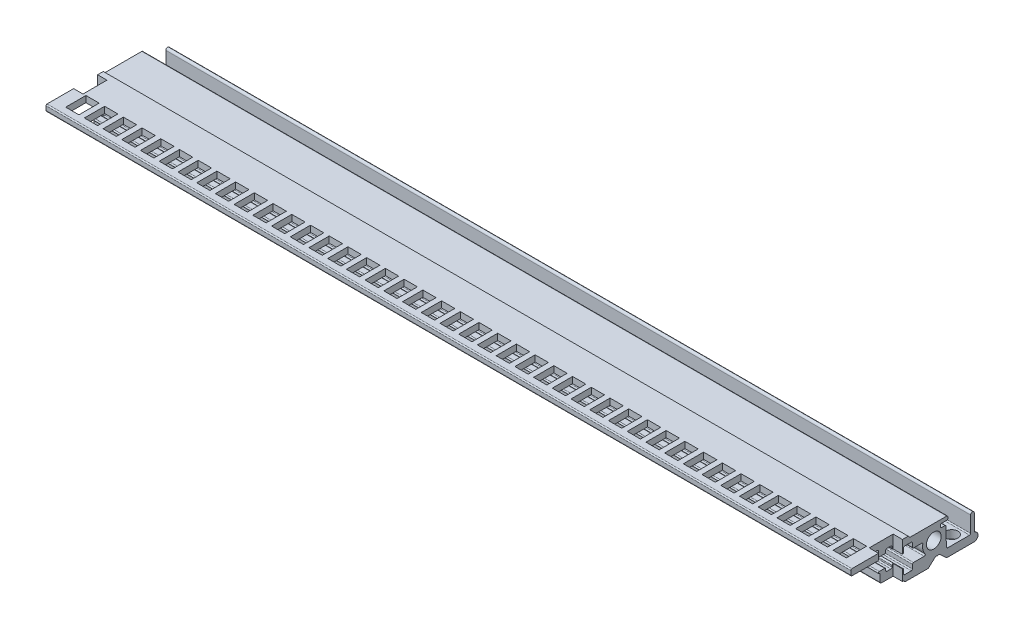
from build123d import *

# Parameters (mm, degrees)
SKETCH_1_R          = 2
EXTRUDE_1_DEPTH     = 109.22
EXTRUDE_4_DEPTH     = 218.44
EXTRUDE_3_DEPTH     = 218.44
CUT_EXTRUDE_1_REACH = 114.803
SKETCH_3_W          = 2.54
SKETCH_3_H          = 6.5
SKETCH_4_R          = 1.65
CUT_EXTRUDE_2_DEPTH = 9.8
SKETCH_5_W          = 3.6
SKETCH_5_H          = 5.5
CUT_EXTRUDE_3_DEPTH = 9.9
FILLET_1_R          = 0.3


with BuildPart() as part:
    # Sketch 1 → Extrude 1 (new, symmetric)
    with BuildSketch(Plane(origin=(0, 0, 0), x_dir=(0, 0, -1), z_dir=(1, 0, 0))):
        with BuildLine():
            Line((2.006061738, 2.145757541), (2.056061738, 2.145757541))
            ThreePointArc((2.056061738, 2.145757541), (2.197483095, 2.087178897), (2.256061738, 1.945757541))
            Line((2.256061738, 1.945757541), (2.256061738, -0.054242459))
            ThreePointArc((2.256061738, -0.054242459), (2.343929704, -0.266374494), (2.556061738, -0.354242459))
            Line((2.556061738, -0.354242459), (6.056061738, -0.354242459))
            ThreePointArc((6.056061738, -0.354242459), (6.245798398, -0.421863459), (6.350000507, -0.594242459))
            ThreePointArc((6.350000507, -0.594242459), (6.41946858, -0.709161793), (6.545959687, -0.754242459))
            Line((6.545959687, -0.754242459), (12.640079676, -0.754242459))
            ThreePointArc((12.640079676, -0.754242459), (12.748258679, -0.734059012), (12.841881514, -0.676224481))
            Line((12.841881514, -0.676224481), (14.682337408, 0.99691724))
            ThreePointArc((14.682337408, 0.99691724), (14.873755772, 1.07475547), (15.070100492, 1.010346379))
            ThreePointArc((15.070100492, 1.010346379), (15.256061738, 0.945757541), (15.442022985, 1.010346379))
            ThreePointArc((15.442022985, 1.010346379), (15.638367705, 1.07475547), (15.829786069, 0.99691724))
            Line((15.829786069, 0.99691724), (17.670241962, -0.676224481))
            ThreePointArc((17.670241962, -0.676224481), (17.763864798, -0.734059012), (17.872043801, -0.754242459))
            Line((17.872043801, -0.754242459), (25.156061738, -0.754242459))
            ThreePointArc((25.156061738, -0.754242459), (26.244537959, 0.186951), (25.470347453, 1.399903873))
            ThreePointArc((25.470347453, 1.399903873), (25.315526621, 1.508114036), (25.256061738, 1.687398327))
            Line((25.256061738, 1.687398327), (25.256061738, 6.045757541))
            ThreePointArc((25.256061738, 6.045757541), (24.756061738, 6.545757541), (24.256061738, 6.045757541))
            Line((24.256061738, 6.045757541), (24.256061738, 1.745757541))
            ThreePointArc((24.256061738, 1.745757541), (24.168193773, 1.533625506), (23.956061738, 1.445757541))
            Line((23.956061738, 1.445757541), (18.056061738, 1.445757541))
            ThreePointArc((18.056061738, 1.445757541), (17.843929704, 1.533625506), (17.756061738, 1.745757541))
            Line((17.756061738, 1.745757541), (17.756061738, 3.099347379))
            ThreePointArc((17.756061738, 3.099347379), (17.729266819, 3.199347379), (17.656061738, 3.27255246))
            ThreePointArc((17.656061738, 3.27255246), (17.582856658, 3.345757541), (17.556061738, 3.445757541))
            Line((17.556061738, 3.445757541), (17.556061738, 6.745757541))
            ThreePointArc((17.556061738, 6.745757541), (17.468193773, 6.957889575), (17.256061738, 7.045757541))
            Line((17.256061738, 7.045757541), (16.356061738, 7.045757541))
            ThreePointArc((16.356061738, 7.045757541), (16.143929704, 7.133625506), (16.056061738, 7.345757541))
            Line((16.056061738, 7.345757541), (16.056061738, 7.745757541))
            ThreePointArc((16.056061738, 7.745757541), (16.143929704, 7.957889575), (16.356061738, 8.045757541))
            Line((16.356061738, 8.045757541), (17.756061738, 8.045757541))
            ThreePointArc((17.756061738, 8.045757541), (17.968193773, 8.133625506), (18.056061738, 8.345757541))
            Line((18.056061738, 8.345757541), (18.056061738, 8.745757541))
            ThreePointArc((18.056061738, 8.745757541), (17.968193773, 8.957889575), (17.756061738, 9.045757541))
            Line((17.756061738, 9.045757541), (-7.943938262, 9.045757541))
            ThreePointArc((-7.943938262, 9.045757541), (-8.156070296, 8.957889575), (-8.243938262, 8.745757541))
            Line((-8.243938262, 8.745757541), (-8.243938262, 8.145757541))
            ThreePointArc((-8.243938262, 8.145757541), (-8.156070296, 7.933625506), (-7.943938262, 7.845757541))
            Line((-7.943938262, 7.845757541), (1.456061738, 7.845757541))
            ThreePointArc((1.456061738, 7.845757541), (1.668193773, 7.757889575), (1.756061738, 7.545757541))
            Line((1.756061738, 7.545757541), (1.756061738, 6.345757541))
            ThreePointArc((1.756061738, 6.345757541), (1.843929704, 6.133625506), (2.056061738, 6.045757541))
            Line((2.056061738, 6.045757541), (3.456061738, 6.045757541))
            ThreePointArc((3.456061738, 6.045757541), (3.668193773, 6.133625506), (3.756061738, 6.345757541))
            Line((3.756061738, 6.345757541), (3.756061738, 6.745757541))
            ThreePointArc((3.756061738, 6.745757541), (3.843929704, 6.957889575), (4.056061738, 7.045757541))
            Line((4.056061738, 7.045757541), (5.156061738, 7.045757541))
            ThreePointArc((5.156061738, 7.045757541), (5.368193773, 6.957889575), (5.456061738, 6.745757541))
            Line((5.456061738, 6.745757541), (5.456061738, 6.345757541))
            ThreePointArc((5.456061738, 6.345757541), (5.756061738, 6.045757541), (6.056061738, 6.345757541))
            Line((6.056061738, 6.345757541), (6.056061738, 7.405757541))
            ThreePointArc((6.056061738, 7.405757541), (6.143929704, 7.617889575), (6.356061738, 7.705757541))
            Line((6.356061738, 7.705757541), (8.156061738, 7.705757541))
            ThreePointArc((8.156061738, 7.705757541), (8.368193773, 7.617889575), (8.456061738, 7.405757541))
            Line((8.456061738, 7.405757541), (8.456061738, 6.345757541))
            ThreePointArc((8.456061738, 6.345757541), (8.543929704, 6.133625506), (8.756061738, 6.045757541))
            Line((8.756061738, 6.045757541), (10.980012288, 6.045757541))
            ThreePointArc((10.980012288, 6.045757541), (11.213256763, 5.934429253), (11.273389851, 5.683070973))
            ThreePointArc((11.273389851, 5.683070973), (11.28883719, 4.340010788), (11.879723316, 3.133817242))
            ThreePointArc((11.879723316, 3.133817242), (11.916556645, 2.816177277), (11.645985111, 2.645757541))
            Line((11.645985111, 2.645757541), (8.756061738, 2.645757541))
            ThreePointArc((8.756061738, 2.645757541), (8.543929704, 2.557889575), (8.456061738, 2.345757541))
            Line((8.456061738, 2.345757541), (8.456061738, 1.285757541))
            ThreePointArc((8.456061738, 1.285757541), (8.368193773, 1.073625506), (8.156061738, 0.985757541))
            Line((8.156061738, 0.985757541), (6.356061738, 0.985757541))
            ThreePointArc((6.356061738, 0.985757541), (6.143929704, 1.073625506), (6.056061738, 1.285757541))
            Line((6.056061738, 1.285757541), (6.056061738, 2.345757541))
            ThreePointArc((6.056061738, 2.345757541), (5.756061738, 2.645757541), (5.456061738, 2.345757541))
            Line((5.456061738, 2.345757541), (5.456061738, 1.945757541))
            ThreePointArc((5.456061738, 1.945757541), (5.368193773, 1.733625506), (5.156061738, 1.645757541))
            Line((5.156061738, 1.645757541), (4.056061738, 1.645757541))
            ThreePointArc((4.056061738, 1.645757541), (3.843929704, 1.733625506), (3.756061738, 1.945757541))
            Line((3.756061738, 1.945757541), (3.756061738, 2.345757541))
            ThreePointArc((3.756061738, 2.345757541), (3.668193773, 2.557889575), (3.456061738, 2.645757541))
            Line((3.456061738, 2.645757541), (2.006061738, 2.645757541))
            ThreePointArc((2.006061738, 2.645757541), (1.756061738, 2.395757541), (2.006061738, 2.145757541))
        make_face()
        with Locations((14.256061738, 5.045757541)):
            Circle(SKETCH_1_R, mode=Mode.SUBTRACT)
    extrude(amount=EXTRUDE_1_DEPTH, both=True)

    # Sketch 7 → Extrude 4 (add, through all)
    with BuildSketch(Plane(origin=(109.22, 0, 0), x_dir=(0, 0, -1), z_dir=(1, 0, 0))):
        with BuildLine():
            Line((-7.943938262, 9.045757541), (-8.243938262, 9.045757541))
            Line((-8.243938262, 9.045757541), (-8.243938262, 8.745757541))
            ThreePointArc((-8.243938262, 8.745757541), (-8.156070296, 8.957889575), (-7.943938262, 9.045757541))
        make_face()
    extrude(amount=-EXTRUDE_4_DEPTH)

    # Sketch 6 → Extrude 3 (add, through all)
    with BuildSketch(Plane.ZY.offset(109.22)):
        Polygon((-7.806061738, 9.045757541), (8.243938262, 9.045757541), (8.243938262, 9.545757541), (-7.306061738, 9.545757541), align=None)
    extrude(amount=-EXTRUDE_3_DEPTH)

    # Cut-Extrude 1: up to this face of the body (flat: up to its plane)
    cut_extrude_1_end = Plane(part.part.faces().sort_by_distance((0, -0.754242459, -9.593019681))[0])
    # Sketch 3 → Cut-Extrude 1 (cut, up to the picked face)
    with BuildSketch(Plane(origin=(0, 9.545757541, 0), x_dir=(1, 0, 0), z_dir=(0, 1, 0)), mode=Mode.PRIVATE) as cut_extrude_1_sk1:
        with Locations((107.95, 2.506061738)):
            Rectangle(SKETCH_3_W, SKETCH_3_H)
    cut_extrude_1_tool1 = split(extrude(cut_extrude_1_sk1.sketch, amount=-CUT_EXTRUDE_1_REACH, mode=Mode.PRIVATE), bisect_by=cut_extrude_1_end, keep=Keep.BOTH, mode=Mode.PRIVATE)
    # Sketch 3 → Cut-Extrude 1 (cut, up to the picked face)
    with BuildSketch(Plane(origin=(0, 9.545757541, 0), x_dir=(1, 0, 0), z_dir=(0, 1, 0)), mode=Mode.PRIVATE) as cut_extrude_1_sk2:
        with Locations((-107.95, 2.506061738)):
            Rectangle(SKETCH_3_W, SKETCH_3_H)
    cut_extrude_1_tool2 = split(extrude(cut_extrude_1_sk2.sketch, amount=-CUT_EXTRUDE_1_REACH, mode=Mode.PRIVATE), bisect_by=cut_extrude_1_end, keep=Keep.BOTH, mode=Mode.PRIVATE)
    add(cut_extrude_1_tool1.solids().sort_by(Axis((107.95, 9.545758, -2.506062), (0, -1, 0)))[0], mode=Mode.SUBTRACT)
    add(cut_extrude_1_tool2.solids().sort_by(Axis((-107.95, 9.545758, -2.506062), (0, -1, 0)))[0], mode=Mode.SUBTRACT)

    # Sketch 4 → Cut-Extrude 2 (cut)
    with BuildSketch(Plane(origin=(0, -0.754242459, 0), x_dir=(-1, 0, 0), z_dir=(0, -1, 0))):
        with Locations(Location((-106.68, 21.706061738, 0), (0, 0, 90))):
            Circle(SKETCH_4_R)
        with Locations(Location((-101.6, 21.706061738, 0), (0, 0, 90))):
            Circle(SKETCH_4_R)
        with Locations(Location((-96.52, 21.706061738, 0), (0, 0, 90))):
            Circle(SKETCH_4_R)
        with Locations(Location((-91.44, 21.706061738, 0), (0, 0, 90))):
            Circle(SKETCH_4_R)
        with Locations(Location((-86.36, 21.706061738, 0), (0, 0, 90))):
            Circle(SKETCH_4_R)
        with Locations(Location((-81.28, 21.706061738, 0), (0, 0, 90))):
            Circle(SKETCH_4_R)
        with Locations(Location((-76.2, 21.706061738, 0), (0, 0, 90))):
            Circle(SKETCH_4_R)
        with Locations(Location((-71.12, 21.706061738, 0), (0, 0, 90))):
            Circle(SKETCH_4_R)
        with Locations(Location((-66.04, 21.706061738, 0), (0, 0, 90))):
            Circle(SKETCH_4_R)
        with Locations(Location((-60.96, 21.706061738, 0), (0, 0, 90))):
            Circle(SKETCH_4_R)
        with Locations(Location((-55.88, 21.706061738, 0), (0, 0, 90))):
            Circle(SKETCH_4_R)
        with Locations(Location((-50.8, 21.706061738, 0), (0, 0, 90))):
            Circle(SKETCH_4_R)
        with Locations(Location((-45.72, 21.706061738, 0), (0, 0, 90))):
            Circle(SKETCH_4_R)
        with Locations(Location((-40.64, 21.706061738, 0), (0, 0, 90))):
            Circle(SKETCH_4_R)
        with Locations(Location((-35.56, 21.706061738, 0), (0, 0, 90))):
            Circle(SKETCH_4_R)
        with Locations(Location((-30.48, 21.706061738, 0), (0, 0, 90))):
            Circle(SKETCH_4_R)
        with Locations(Location((-25.4, 21.706061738, 0), (0, 0, 90))):
            Circle(SKETCH_4_R)
        with Locations(Location((-20.32, 21.706061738, 0), (0, 0, 90))):
            Circle(SKETCH_4_R)
        with Locations(Location((-15.24, 21.706061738, 0), (0, 0, 90))):
            Circle(SKETCH_4_R)
        with Locations(Location((-10.16, 21.706061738, 0), (0, 0, 90))):
            Circle(SKETCH_4_R)
        with Locations(Location((-5.08, 21.706061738, 0), (0, 0, 90))):
            Circle(SKETCH_4_R)
        with Locations(Location((0, 21.706061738, 0), (0, 0, 90))):
            Circle(SKETCH_4_R)
        with Locations(Location((5.08, 21.706061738, 0), (0, 0, 90))):
            Circle(SKETCH_4_R)
        with Locations(Location((10.16, 21.706061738, 0), (0, 0, 90))):
            Circle(SKETCH_4_R)
        with Locations(Location((15.24, 21.706061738, 0), (0, 0, 90))):
            Circle(SKETCH_4_R)
        with Locations(Location((20.32, 21.706061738, 0), (0, 0, 90))):
            Circle(SKETCH_4_R)
        with Locations(Location((25.4, 21.706061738, 0), (0, 0, 90))):
            Circle(SKETCH_4_R)
        with Locations(Location((30.48, 21.706061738, 0), (0, 0, 90))):
            Circle(SKETCH_4_R)
        with Locations(Location((35.56, 21.706061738, 0), (0, 0, 90))):
            Circle(SKETCH_4_R)
        with Locations(Location((40.64, 21.706061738, 0), (0, 0, 90))):
            Circle(SKETCH_4_R)
        with Locations(Location((45.72, 21.706061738, 0), (0, 0, 90))):
            Circle(SKETCH_4_R)
        with Locations(Location((50.8, 21.706061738, 0), (0, 0, 90))):
            Circle(SKETCH_4_R)
        with Locations(Location((55.88, 21.706061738, 0), (0, 0, 90))):
            Circle(SKETCH_4_R)
        with Locations(Location((60.96, 21.706061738, 0), (0, 0, 90))):
            Circle(SKETCH_4_R)
        with Locations(Location((66.04, 21.706061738, 0), (0, 0, 90))):
            Circle(SKETCH_4_R)
        with Locations(Location((71.12, 21.706061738, 0), (0, 0, 90))):
            Circle(SKETCH_4_R)
        with Locations(Location((76.2, 21.706061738, 0), (0, 0, 90))):
            Circle(SKETCH_4_R)
        with Locations(Location((81.28, 21.706061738, 0), (0, 0, 90))):
            Circle(SKETCH_4_R)
        with Locations(Location((86.36, 21.706061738, 0), (0, 0, 90))):
            Circle(SKETCH_4_R)
        with Locations(Location((91.44, 21.706061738, 0), (0, 0, 90))):
            Circle(SKETCH_4_R)
        with Locations(Location((96.52, 21.706061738, 0), (0, 0, 90))):
            Circle(SKETCH_4_R)
        with Locations(Location((101.6, 21.706061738, 0), (0, 0, 90))):
            Circle(SKETCH_4_R)
        with Locations(Location((106.68, 21.706061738, 0), (0, 0, 90))):
            Circle(SKETCH_4_R)
    extrude(amount=-CUT_EXTRUDE_2_DEPTH, mode=Mode.SUBTRACT)

    # Sketch 5 → Cut-Extrude 3 (cut)
    with BuildSketch(Plane(origin=(0, 9.545757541, 0), x_dir=(1, 0, 0), z_dir=(0, 1, 0))):
        with Locations((-104.14, -3.443938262)):
            Rectangle(SKETCH_5_W, SKETCH_5_H)
        with Locations((-99.06, -3.443938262)):
            Rectangle(SKETCH_5_W, SKETCH_5_H)
        with Locations((-93.98, -3.443938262)):
            Rectangle(SKETCH_5_W, SKETCH_5_H)
        with Locations((-88.9, -3.443938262)):
            Rectangle(SKETCH_5_W, SKETCH_5_H)
        with Locations((-83.82, -3.443938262)):
            Rectangle(SKETCH_5_W, SKETCH_5_H)
        with Locations((-78.74, -3.443938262)):
            Rectangle(SKETCH_5_W, SKETCH_5_H)
        with Locations((-73.66, -3.443938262)):
            Rectangle(SKETCH_5_W, SKETCH_5_H)
        with Locations((-68.58, -3.443938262)):
            Rectangle(SKETCH_5_W, SKETCH_5_H)
        with Locations((-63.5, -3.443938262)):
            Rectangle(SKETCH_5_W, SKETCH_5_H)
        with Locations((-58.42, -3.443938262)):
            Rectangle(SKETCH_5_W, SKETCH_5_H)
        with Locations((-53.34, -3.443938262)):
            Rectangle(SKETCH_5_W, SKETCH_5_H)
        with Locations((-48.26, -3.443938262)):
            Rectangle(SKETCH_5_W, SKETCH_5_H)
        with Locations((-43.18, -3.443938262)):
            Rectangle(SKETCH_5_W, SKETCH_5_H)
        with Locations((-38.1, -3.443938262)):
            Rectangle(SKETCH_5_W, SKETCH_5_H)
        with Locations((-33.02, -3.443938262)):
            Rectangle(SKETCH_5_W, SKETCH_5_H)
        with Locations((-27.94, -3.443938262)):
            Rectangle(SKETCH_5_W, SKETCH_5_H)
        with Locations((-22.86, -3.443938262)):
            Rectangle(SKETCH_5_W, SKETCH_5_H)
        with Locations((-17.78, -3.443938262)):
            Rectangle(SKETCH_5_W, SKETCH_5_H)
        with Locations((-12.7, -3.443938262)):
            Rectangle(SKETCH_5_W, SKETCH_5_H)
        with Locations((-7.62, -3.443938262)):
            Rectangle(SKETCH_5_W, SKETCH_5_H)
        with Locations((-2.54, -3.443938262)):
            Rectangle(SKETCH_5_W, SKETCH_5_H)
        with Locations((2.54, -3.443938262)):
            Rectangle(SKETCH_5_W, SKETCH_5_H)
        with Locations((7.62, -3.443938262)):
            Rectangle(SKETCH_5_W, SKETCH_5_H)
        with Locations((12.7, -3.443938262)):
            Rectangle(SKETCH_5_W, SKETCH_5_H)
        with Locations((17.78, -3.443938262)):
            Rectangle(SKETCH_5_W, SKETCH_5_H)
        with Locations((22.86, -3.443938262)):
            Rectangle(SKETCH_5_W, SKETCH_5_H)
        with Locations((27.94, -3.443938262)):
            Rectangle(SKETCH_5_W, SKETCH_5_H)
        with Locations((33.02, -3.443938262)):
            Rectangle(SKETCH_5_W, SKETCH_5_H)
        with Locations((38.1, -3.443938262)):
            Rectangle(SKETCH_5_W, SKETCH_5_H)
        with Locations((43.18, -3.443938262)):
            Rectangle(SKETCH_5_W, SKETCH_5_H)
        with Locations((48.26, -3.443938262)):
            Rectangle(SKETCH_5_W, SKETCH_5_H)
        with Locations((53.34, -3.443938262)):
            Rectangle(SKETCH_5_W, SKETCH_5_H)
        with Locations((58.42, -3.443938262)):
            Rectangle(SKETCH_5_W, SKETCH_5_H)
        with Locations((63.5, -3.443938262)):
            Rectangle(SKETCH_5_W, SKETCH_5_H)
        with Locations((68.58, -3.443938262)):
            Rectangle(SKETCH_5_W, SKETCH_5_H)
        with Locations((73.66, -3.443938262)):
            Rectangle(SKETCH_5_W, SKETCH_5_H)
        with Locations((78.74, -3.443938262)):
            Rectangle(SKETCH_5_W, SKETCH_5_H)
        with Locations((83.82, -3.443938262)):
            Rectangle(SKETCH_5_W, SKETCH_5_H)
        with Locations((88.9, -3.443938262)):
            Rectangle(SKETCH_5_W, SKETCH_5_H)
        with Locations((93.98, -3.443938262)):
            Rectangle(SKETCH_5_W, SKETCH_5_H)
        with Locations((99.06, -3.443938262)):
            Rectangle(SKETCH_5_W, SKETCH_5_H)
        with Locations((104.14, -3.443938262)):
            Rectangle(SKETCH_5_W, SKETCH_5_H)
    extrude(amount=-CUT_EXTRUDE_3_DEPTH, mode=Mode.SUBTRACT)

    # Fillet 1
    fillet_1_edges = [part.edges().sort_by_distance(p)[0] for p in [
        (0, 9.545757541, 8.243938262),
    ]]
    fillet(fillet_1_edges, radius=FILLET_1_R)


solid = part.part
